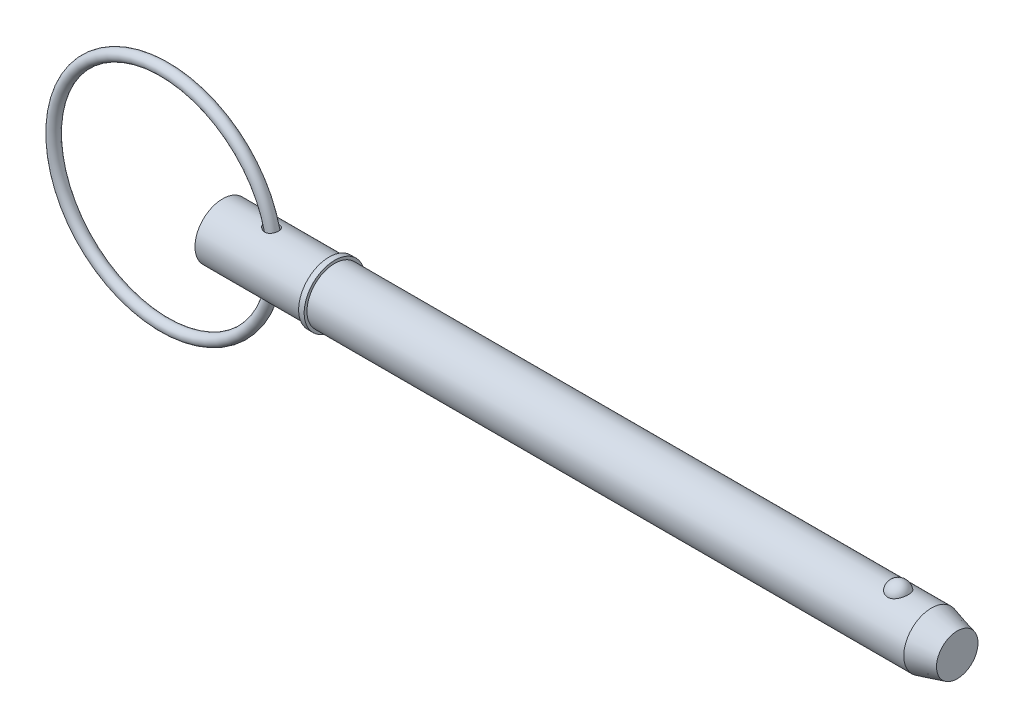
ISO-10303-21;
HEADER;
FILE_DESCRIPTION(('STEP AP214'),'2;1');
FILE_NAME('part.step','',(''),(''),'','','');
FILE_SCHEMA(('AUTOMOTIVE_DESIGN { 1 0 10303 214 1 1 1 1 }'));
ENDSEC;
DATA;
#1=APPLICATION_CONTEXT('core data for automotive mechanical design processes');
#2=APPLICATION_PROTOCOL_DEFINITION('international standard','automotive_design',2000,#1);
#3=PRODUCT_CONTEXT('',#1,'mechanical');
#4=PRODUCT('Part','Part','',(#3));
#5=PRODUCT_RELATED_PRODUCT_CATEGORY('part','',(#4));
#6=PRODUCT_DEFINITION_FORMATION('','',#4);
#7=PRODUCT_DEFINITION_CONTEXT('part definition',#1,'design');
#8=PRODUCT_DEFINITION('design','',#6,#7);
#9=PRODUCT_DEFINITION_SHAPE('','',#8);
#10=(LENGTH_UNIT() NAMED_UNIT(*) SI_UNIT(.MILLI.,.METRE.));
#11=(NAMED_UNIT(*) PLANE_ANGLE_UNIT() SI_UNIT($,.RADIAN.));
#12=(NAMED_UNIT(*) SI_UNIT($,.STERADIAN.) SOLID_ANGLE_UNIT());
#13=UNCERTAINTY_MEASURE_WITH_UNIT(LENGTH_MEASURE(1.E-05),#10,'distance_accuracy_value','');
#14=(GEOMETRIC_REPRESENTATION_CONTEXT(3) GLOBAL_UNCERTAINTY_ASSIGNED_CONTEXT((#13)) GLOBAL_UNIT_ASSIGNED_CONTEXT((#10,
#11,#12)) REPRESENTATION_CONTEXT('',''));
#15=CARTESIAN_POINT('',(0.,0.,0.));
#16=DIRECTION('',(0.,0.,1.));
#17=DIRECTION('',(1.,0.,0.));
#18=AXIS2_PLACEMENT_3D('',#15,#16,#17);
#19=CARTESIAN_POINT('',(-13.3798047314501,0.,0.));
#20=DIRECTION('',(0.,0.,1.));
#21=DIRECTION('',(1.,0.,0.));
#22=AXIS2_PLACEMENT_3D('',#19,#20,#21);
#23=TOROIDAL_SURFACE('',#22,25.4,1.27);
#24=CARTESIAN_POINT('',(13.2901952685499,0.,0.));
#25=VERTEX_POINT('',#24);
#26=VERTEX_LOOP('',#25);
#27=FACE_BOUND('',#26,.T.);
#28=ADVANCED_FACE('P0_F12',(#27),#23,.T.);
#29=CLOSED_SHELL('',(#28));
#30=MANIFOLD_SOLID_BREP('P0_B1',#29);
#31=CARTESIAN_POINT('',(0.,0.,0.));
#32=DIRECTION('',(1.,0.,0.));
#33=DIRECTION('',(0.,0.,-1.));
#34=AXIS2_PLACEMENT_3D('',#31,#32,#33);
#35=CYLINDRICAL_SURFACE('',#34,6.35);
#36=CARTESIAN_POINT('',(9.67500140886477,6.32698634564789,-0.540133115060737));
#37=CARTESIAN_POINT('',(9.70878953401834,6.3197498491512,-0.624879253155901));
#38=CARTESIAN_POINT('',(9.75028044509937,6.31105328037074,-0.706504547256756));
#39=CARTESIAN_POINT('',(9.84659255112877,6.29180070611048,-0.861319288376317));
#40=CARTESIAN_POINT('',(9.90144039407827,6.28124099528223,-0.934491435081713));
#41=CARTESIAN_POINT('',(10.021999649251,6.25949497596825,-1.0704877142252));
#42=CARTESIAN_POINT('',(10.0876589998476,6.2483118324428,-1.13335868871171));
#43=CARTESIAN_POINT('',(10.2280180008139,6.22641783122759,-1.24805262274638));
#44=CARTESIAN_POINT('',(10.3027159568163,6.21570688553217,-1.29987764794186));
#45=CARTESIAN_POINT('',(10.4650889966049,6.19509606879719,-1.39492899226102));
#46=CARTESIAN_POINT('',(10.5533142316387,6.1853135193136,-1.4372443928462));
#47=CARTESIAN_POINT('',(10.7357818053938,6.16871128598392,-1.50691441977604));
#48=CARTESIAN_POINT('',(10.8300253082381,6.16189217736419,-1.53426614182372));
#49=CARTESIAN_POINT('',(11.0227953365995,6.15211299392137,-1.57302798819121));
#50=CARTESIAN_POINT('',(11.1213511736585,6.14918579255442,-1.58430237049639));
#51=CARTESIAN_POINT('',(11.3189518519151,6.1478413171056,-1.58951619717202));
#52=CARTESIAN_POINT('',(11.417996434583,6.14942187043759,-1.58346399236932));
#53=CARTESIAN_POINT('',(11.6070859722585,6.15678569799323,-1.55457003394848));
#54=CARTESIAN_POINT('',(11.6973059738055,6.16229943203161,-1.53280404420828));
#55=CARTESIAN_POINT('',(11.8723373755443,6.17663058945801,-1.4739892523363));
#56=CARTESIAN_POINT('',(11.9571502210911,6.185447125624,-1.43694455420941));
#57=CARTESIAN_POINT('',(12.1146737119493,6.20482821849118,-1.35072170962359));
#58=CARTESIAN_POINT('',(12.1877743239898,6.21528554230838,-1.30222952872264));
#59=CARTESIAN_POINT('',(12.3246187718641,6.23705116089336,-1.19362916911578));
#60=CARTESIAN_POINT('',(12.3883628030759,6.24835943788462,-1.1335212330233));
#61=CARTESIAN_POINT('',(12.5046662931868,6.27053957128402,-1.00357204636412));
#62=CARTESIAN_POINT('',(12.5572571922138,6.28141258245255,-0.933759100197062));
#63=CARTESIAN_POINT('',(12.6502125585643,6.30157953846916,-0.786214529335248));
#64=CARTESIAN_POINT('',(12.6905764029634,6.31087340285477,-0.708482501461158));
#65=CARTESIAN_POINT('',(12.7585531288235,6.32699259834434,-0.546246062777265));
#66=CARTESIAN_POINT('',(12.7860022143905,6.33378599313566,-0.46166981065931));
#67=CARTESIAN_POINT('',(12.8267605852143,6.34401050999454,-0.288980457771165));
#68=CARTESIAN_POINT('',(12.8400695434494,6.34744155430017,-0.200867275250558));
#69=CARTESIAN_POINT('',(12.8522644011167,6.35058177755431,-0.023194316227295));
#70=CARTESIAN_POINT('',(12.8510870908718,6.35027464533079,0.0663700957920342));
#71=CARTESIAN_POINT('',(12.8341831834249,6.34593169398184,0.244024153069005));
#72=CARTESIAN_POINT('',(12.8184563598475,6.341895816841,0.332113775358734));
#73=CARTESIAN_POINT('',(12.7728208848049,6.33052992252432,0.504322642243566));
#74=CARTESIAN_POINT('',(12.7429114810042,6.32319973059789,0.58844167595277));
#75=CARTESIAN_POINT('',(12.6696162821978,6.30604116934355,0.750316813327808));
#76=CARTESIAN_POINT('',(12.6262302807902,6.29621276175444,0.828072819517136));
#77=CARTESIAN_POINT('',(12.5270856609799,6.27515240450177,0.974918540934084));
#78=CARTESIAN_POINT('',(12.4713403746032,6.26392197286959,1.04401746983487));
#79=CARTESIAN_POINT('',(12.3488662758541,6.24131002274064,1.1716478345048));
#80=CARTESIAN_POINT('',(12.2821384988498,6.22992851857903,1.23018026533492));
#81=CARTESIAN_POINT('',(12.1401870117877,6.20841765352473,1.33449214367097));
#82=CARTESIAN_POINT('',(12.0650507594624,6.19827734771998,1.38038832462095));
#83=CARTESIAN_POINT('',(11.9079044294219,6.18026478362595,1.45892404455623));
#84=CARTESIAN_POINT('',(11.8258951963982,6.17239224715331,1.49156520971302));
#85=CARTESIAN_POINT('',(11.6581736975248,6.15982613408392,1.54263810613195));
#86=CARTESIAN_POINT('',(11.572502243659,6.15510409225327,1.56119728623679));
#87=CARTESIAN_POINT('',(11.3991899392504,6.14916283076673,1.58443707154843));
#88=CARTESIAN_POINT('',(11.3115488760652,6.14794399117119,1.58911617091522));
#89=CARTESIAN_POINT('',(11.1345547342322,6.14904466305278,1.58485137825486));
#90=CARTESIAN_POINT('',(11.0452104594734,6.15144894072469,1.5755811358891));
#91=CARTESIAN_POINT('',(10.8691479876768,6.15957601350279,1.54349959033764));
#92=CARTESIAN_POINT('',(10.782430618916,6.16529984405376,1.52068406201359));
#93=CARTESIAN_POINT('',(10.6082848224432,6.17983892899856,1.4605156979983));
#94=CARTESIAN_POINT('',(10.5211557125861,6.1888262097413,1.42233764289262));
#95=CARTESIAN_POINT('',(10.3542377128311,6.20874782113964,1.33268652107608));
#96=CARTESIAN_POINT('',(10.2744521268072,6.21968302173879,1.28120750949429));
#97=CARTESIAN_POINT('',(10.120854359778,6.24282707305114,1.16334748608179));
#98=CARTESIAN_POINT('',(10.0474902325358,6.25507146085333,1.09638652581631));
#99=CARTESIAN_POINT('',(9.9136869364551,6.27890019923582,0.950453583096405));
#100=CARTESIAN_POINT('',(9.85324511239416,6.29048468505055,0.871484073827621));
#101=CARTESIAN_POINT('',(9.75037543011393,6.31102161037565,0.707140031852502));
#102=CARTESIAN_POINT('',(9.70726585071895,6.32006820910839,0.622206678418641));
#103=CARTESIAN_POINT('',(9.63775895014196,6.33497125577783,0.445490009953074));
#104=CARTESIAN_POINT('',(9.61134627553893,6.34083063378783,0.35371307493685));
#105=CARTESIAN_POINT('',(9.57891955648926,6.34807071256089,0.177220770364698));
#106=CARTESIAN_POINT('',(9.57093524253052,6.3498832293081,0.0928817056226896));
#107=CARTESIAN_POINT('',(9.56994851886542,6.35010532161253,-0.0758268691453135));
#108=CARTESIAN_POINT('',(9.57692695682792,6.34851924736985,-0.160196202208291));
#109=CARTESIAN_POINT('',(9.59985709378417,6.34339435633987,-0.294043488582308));
#110=CARTESIAN_POINT('',(9.61128951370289,6.34084912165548,-0.344385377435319));
#111=CARTESIAN_POINT('',(9.63933183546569,6.33468615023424,-0.443526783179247));
#112=CARTESIAN_POINT('',(9.65594100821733,6.33106856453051,-0.492326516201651));
#113=CARTESIAN_POINT('',(9.67500140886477,6.32698634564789,-0.540133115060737));
#114=B_SPLINE_CURVE_WITH_KNOTS('',3,(#36,#37,#38,#39,#40,#41,#42,#43,#44,#45,#46,#47,#48,#49,
#50,#51,#52,#53,#54,#55,#56,#57,#58,#59,#60,#61,#62,#63,#64,#65,#66,#67,#68,#69,#70,#71,#72,#73,
#74,#75,#76,#77,#78,#79,#80,#81,#82,#83,#84,#85,#86,#87,#88,#89,#90,#91,#92,#93,#94,#95,#96,#97,
#98,#99,#100,#101,#102,#103,#104,#105,#106,#107,#108,#109,#110,#111,#112,#113),.UNSPECIFIED.,
.T.,.F.,(4,2,2,2,2,2,2,2,2,2,2,2,2,2,2,2,2,2,2,2,2,2,2,2,2,2,2,2,2,2,2,2,2,2,2,2,2,2,4),(0.,
0.274348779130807,0.549249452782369,0.822863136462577,1.09642560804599,1.39007706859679,
1.68378550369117,1.97995934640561,2.27599046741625,2.55347281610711,2.83088067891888,
3.09465189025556,3.35841759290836,3.62142956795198,3.88445494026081,4.1507318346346,
4.4170148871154,4.68446025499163,4.95190978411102,5.21937350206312,5.48684131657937,
5.75402200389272,6.02117751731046,6.28577524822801,6.55034050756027,6.81248178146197,
7.0746514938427,7.34305086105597,7.61153399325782,7.89692981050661,8.18245340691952,
8.48120635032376,8.77989784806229,9.06530254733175,9.35044442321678,9.60331609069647,
9.85586427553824,10.010650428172,10.1654147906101),.UNSPECIFIED.);
#115=CARTESIAN_POINT('',(9.67500140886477,6.32698634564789,-0.540133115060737));
#116=VERTEX_POINT('',#115);
#117=EDGE_CURVE('P1_E42',#116,#116,#114,.T.);
#118=ORIENTED_EDGE('',*,*,#117,.T.);
#119=EDGE_LOOP('',(#118));
#120=FACE_BOUND('',#119,.T.);
#121=CARTESIAN_POINT('',(0.,0.,0.));
#122=DIRECTION('',(1.,0.,0.));
#123=DIRECTION('',(0.,0.,-1.));
#124=AXIS2_PLACEMENT_3D('',#121,#122,#123);
#125=CIRCLE('',#124,6.35);
#126=CARTESIAN_POINT('',(0.,0.,-6.35));
#127=VERTEX_POINT('',#126);
#128=EDGE_CURVE('P1_E9',#127,#127,#125,.T.);
#129=ORIENTED_EDGE('',*,*,#128,.T.);
#130=EDGE_LOOP('',(#129));
#131=FACE_BOUND('',#130,.T.);
#132=CARTESIAN_POINT('',(24.43,0.,0.));
#133=DIRECTION('',(1.,0.,0.));
#134=DIRECTION('',(0.,0.,-1.));
#135=AXIS2_PLACEMENT_3D('',#132,#133,#134);
#136=CIRCLE('',#135,6.35);
#137=CARTESIAN_POINT('',(24.43,0.,-6.35));
#138=VERTEX_POINT('',#137);
#139=EDGE_CURVE('P1_E25',#138,#138,#136,.T.);
#140=ORIENTED_EDGE('',*,*,#139,.F.);
#141=EDGE_LOOP('',(#140));
#142=FACE_BOUND('',#141,.T.);
#143=CARTESIAN_POINT('',(9.67500140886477,-6.32698634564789,-0.540133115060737));
#144=CARTESIAN_POINT('',(9.64544894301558,-6.33331515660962,-0.466002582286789));
#145=CARTESIAN_POINT('',(9.62177180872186,-6.33852974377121,-0.389437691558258));
#146=CARTESIAN_POINT('',(9.58727043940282,-6.34619174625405,-0.233330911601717));
#147=CARTESIAN_POINT('',(9.57644043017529,-6.34864040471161,-0.153790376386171));
#148=CARTESIAN_POINT('',(9.56819517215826,-6.3505010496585,0.00612071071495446));
#149=CARTESIAN_POINT('',(9.57079639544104,-6.34990930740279,0.0864921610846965));
#150=CARTESIAN_POINT('',(9.58930797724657,-6.3457478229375,0.245607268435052));
#151=CARTESIAN_POINT('',(9.60522046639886,-6.34217760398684,0.324350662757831));
#152=CARTESIAN_POINT('',(9.64931570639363,-6.3324977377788,0.47727605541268));
#153=CARTESIAN_POINT('',(9.67737525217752,-6.32641361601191,0.551495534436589));
#154=CARTESIAN_POINT('',(9.74451510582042,-6.31231128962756,0.694551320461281));
#155=CARTESIAN_POINT('',(9.78359827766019,-6.30429258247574,0.763386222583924));
#156=CARTESIAN_POINT('',(9.87474700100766,-6.28638332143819,0.899414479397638));
#157=CARTESIAN_POINT('',(9.92757481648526,-6.27639669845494,0.966083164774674));
#158=CARTESIAN_POINT('',(10.042675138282,-6.25596164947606,1.09061181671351));
#159=CARTESIAN_POINT('',(10.1049521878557,-6.24551300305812,1.14846751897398));
#160=CARTESIAN_POINT('',(10.2445505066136,-6.22397505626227,1.26024641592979));
#161=CARTESIAN_POINT('',(10.3227711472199,-6.2129394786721,1.31305951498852));
#162=CARTESIAN_POINT('',(10.4867924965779,-6.19263757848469,1.40570084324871));
#163=CARTESIAN_POINT('',(10.5725962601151,-6.18337197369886,1.44552380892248));
#164=CARTESIAN_POINT('',(10.7543302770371,-6.16725983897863,1.51283687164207));
#165=CARTESIAN_POINT('',(10.8505554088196,-6.16056505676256,1.53957358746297));
#166=CARTESIAN_POINT('',(11.0463546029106,-6.15127671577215,1.57628137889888));
#167=CARTESIAN_POINT('',(11.1459276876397,-6.14868197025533,1.58625730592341));
#168=CARTESIAN_POINT('',(11.3414257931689,-6.14810798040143,1.58848000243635));
#169=CARTESIAN_POINT('',(11.4373417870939,-6.14995283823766,1.58140242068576));
#170=CARTESIAN_POINT('',(11.6262783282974,-6.1577972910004,1.55057566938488));
#171=CARTESIAN_POINT('',(11.719300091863,-6.16379511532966,1.52683360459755));
#172=CARTESIAN_POINT('',(11.8934223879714,-6.17873566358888,1.46514575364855));
#173=CARTESIAN_POINT('',(11.9749048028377,-6.18746207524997,1.42822144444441));
#174=CARTESIAN_POINT('',(12.1301362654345,-6.20693584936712,1.3410564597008));
#175=CARTESIAN_POINT('',(12.2038861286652,-6.21768299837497,1.29081719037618));
#176=CARTESIAN_POINT('',(12.3399792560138,-6.23970077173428,1.17972764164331));
#177=CARTESIAN_POINT('',(12.4025430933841,-6.25095401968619,1.11914355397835));
#178=CARTESIAN_POINT('',(12.5166805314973,-6.27296916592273,0.988307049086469));
#179=CARTESIAN_POINT('',(12.568253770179,-6.28373104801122,0.918054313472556));
#180=CARTESIAN_POINT('',(12.6596230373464,-6.3037060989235,0.769081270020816));
#181=CARTESIAN_POINT('',(12.6992956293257,-6.31290263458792,0.690283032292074));
#182=CARTESIAN_POINT('',(12.7652258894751,-6.32862394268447,0.527011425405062));
#183=CARTESIAN_POINT('',(12.7914829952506,-6.33514860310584,0.442537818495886));
#184=CARTESIAN_POINT('',(12.8301436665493,-6.34487485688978,0.269505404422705));
#185=CARTESIAN_POINT('',(12.8424230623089,-6.34804664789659,0.180917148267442));
#186=CARTESIAN_POINT('',(12.8524214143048,-6.35062347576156,0.00286829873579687));
#187=CARTESIAN_POINT('',(12.8501402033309,-6.35002846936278,-0.0865923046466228));
#188=CARTESIAN_POINT('',(12.8310619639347,-6.34513332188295,-0.263931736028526));
#189=CARTESIAN_POINT('',(12.8142517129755,-6.34082980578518,-0.35180904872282));
#190=CARTESIAN_POINT('',(12.7664911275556,-6.32897674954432,-0.523406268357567));
#191=CARTESIAN_POINT('',(12.7355404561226,-6.3214271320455,-0.607126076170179));
#192=CARTESIAN_POINT('',(12.6602298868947,-6.30390232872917,-0.768030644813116));
#193=CARTESIAN_POINT('',(12.6158695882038,-6.29392707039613,-0.84521521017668));
#194=CARTESIAN_POINT('',(12.5148171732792,-6.2726521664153,-0.990836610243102));
#195=CARTESIAN_POINT('',(12.4581254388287,-6.26135256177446,-1.05927371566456));
#196=CARTESIAN_POINT('',(12.33416419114,-6.2387572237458,-1.18510935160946));
#197=CARTESIAN_POINT('',(12.2669484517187,-6.22746174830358,-1.24256086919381));
#198=CARTESIAN_POINT('',(12.1235592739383,-6.20610255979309,-1.34519464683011));
#199=CARTESIAN_POINT('',(12.0473871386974,-6.19603866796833,-1.39037868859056));
#200=CARTESIAN_POINT('',(11.8892714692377,-6.17839642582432,-1.46678006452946));
#201=CARTESIAN_POINT('',(11.8074126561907,-6.17078838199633,-1.49816605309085));
#202=CARTESIAN_POINT('',(11.6394563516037,-6.15869606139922,-1.54712759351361));
#203=CARTESIAN_POINT('',(11.5533589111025,-6.15421174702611,-1.56470331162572));
#204=CARTESIAN_POINT('',(11.3789660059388,-6.14876652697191,-1.58596734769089));
#205=CARTESIAN_POINT('',(11.2906621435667,-6.1478222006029,-1.58959032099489));
#206=CARTESIAN_POINT('',(11.1146029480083,-6.149490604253,-1.58312110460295));
#207=CARTESIAN_POINT('',(11.0268477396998,-6.1521041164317,-1.57302589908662));
#208=CARTESIAN_POINT('',(10.8498668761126,-6.16071031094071,-1.53898332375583));
#209=CARTESIAN_POINT('',(10.7607726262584,-6.16685908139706,-1.51439468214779));
#210=CARTESIAN_POINT('',(10.5876521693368,-6.18189031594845,-1.45181305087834));
#211=CARTESIAN_POINT('',(10.5036282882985,-6.19077402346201,-1.41381396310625));
#212=CARTESIAN_POINT('',(10.3374228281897,-6.2109378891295,-1.32252480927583));
#213=CARTESIAN_POINT('',(10.255708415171,-6.2223355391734,-1.26840756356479));
#214=CARTESIAN_POINT('',(10.1025645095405,-6.24580740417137,-1.14725208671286));
#215=CARTESIAN_POINT('',(10.0311354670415,-6.25788164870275,-1.08021329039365));
#216=CARTESIAN_POINT('',(9.90472699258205,-6.2806176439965,-0.938710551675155));
#217=CARTESIAN_POINT('',(9.84904456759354,-6.29132066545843,-0.864883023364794));
#218=CARTESIAN_POINT('',(9.75129345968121,-6.31084098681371,-0.708496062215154));
#219=CARTESIAN_POINT('',(9.70921094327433,-6.31966019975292,-0.625945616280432));
#220=CARTESIAN_POINT('',(9.67500140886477,-6.32698634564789,-0.540133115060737));
#221=B_SPLINE_CURVE_WITH_KNOTS('',3,(#143,#144,#145,#146,#147,#148,#149,#150,#151,#152,#153,
#154,#155,#156,#157,#158,#159,#160,#161,#162,#163,#164,#165,#166,#167,#168,#169,#170,#171,#172,
#173,#174,#175,#176,#177,#178,#179,#180,#181,#182,#183,#184,#185,#186,#187,#188,#189,#190,#191,
#192,#193,#194,#195,#196,#197,#198,#199,#200,#201,#202,#203,#204,#205,#206,#207,#208,#209,#210,
#211,#212,#213,#214,#215,#216,#217,#218,#219,#220),.UNSPECIFIED.,.T.,.F.,(4,2,2,2,2,2,2,2,2,2,2,
2,2,2,2,2,2,2,2,2,2,2,2,2,2,2,2,2,2,2,2,2,2,2,2,2,2,2,4),(0.,0.239871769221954,
0.479635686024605,0.719693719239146,0.959790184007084,1.19750645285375,1.43528453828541,
1.69117930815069,1.94719750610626,2.23102979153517,2.51497694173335,2.81376497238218,
3.11246650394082,3.39952951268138,3.68647020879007,3.95479420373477,4.22308987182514,
4.48530700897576,4.74753278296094,5.01239119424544,5.27726070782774,5.54446524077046,
5.81167284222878,6.07912387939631,6.34658129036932,6.61404669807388,6.88150382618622,
7.14763644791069,7.41373039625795,7.67647472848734,7.93921589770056,8.20318607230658,
8.46721428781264,8.74390821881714,9.02072813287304,9.31537622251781,9.61003720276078,
9.88799314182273,10.1656654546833),.UNSPECIFIED.);
#222=CARTESIAN_POINT('',(9.67500140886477,-6.32698634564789,-0.540133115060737));
#223=VERTEX_POINT('',#222);
#224=EDGE_CURVE('P1_E17',#223,#223,#221,.T.);
#225=ORIENTED_EDGE('',*,*,#224,.T.);
#226=EDGE_LOOP('',(#225));
#227=FACE_BOUND('',#226,.T.);
#228=ADVANCED_FACE('P1_F13',(#120,#131,#142,#227),#35,.T.);
#229=CARTESIAN_POINT('',(0.,0.,0.));
#230=DIRECTION('',(1.,0.,0.));
#231=DIRECTION('',(0.,0.,-1.));
#232=AXIS2_PLACEMENT_3D('',#229,#230,#231);
#233=CYLINDRICAL_SURFACE('',#232,6.35);
#234=CARTESIAN_POINT('',(162.655369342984,0.,0.));
#235=DIRECTION('',(1.,0.,0.));
#236=DIRECTION('',(0.,0.,-1.));
#237=AXIS2_PLACEMENT_3D('',#234,#235,#236);
#238=CIRCLE('',#237,6.35);
#239=CARTESIAN_POINT('',(162.655369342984,0.,-6.35));
#240=VERTEX_POINT('',#239);
#241=EDGE_CURVE('P1_E99',#240,#240,#238,.T.);
#242=ORIENTED_EDGE('',*,*,#241,.F.);
#243=EDGE_LOOP('',(#242));
#244=FACE_BOUND('',#243,.T.);
#245=CARTESIAN_POINT('',(25.7,0.,0.));
#246=DIRECTION('',(1.,0.,0.));
#247=DIRECTION('',(0.,0.,-1.));
#248=AXIS2_PLACEMENT_3D('',#245,#246,#247);
#249=CIRCLE('',#248,6.35);
#250=CARTESIAN_POINT('',(25.7,0.,-6.35));
#251=VERTEX_POINT('',#250);
#252=EDGE_CURVE('P1_E96',#251,#251,#249,.T.);
#253=ORIENTED_EDGE('',*,*,#252,.T.);
#254=EDGE_LOOP('',(#253));
#255=FACE_BOUND('',#254,.T.);
#256=CARTESIAN_POINT('',(155.030021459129,5.87502187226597,2.40969251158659));
#257=CARTESIAN_POINT('',(154.905030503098,5.87501645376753,2.40969773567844));
#258=CARTESIAN_POINT('',(154.780080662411,5.87916061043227,2.39967292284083));
#259=CARTESIAN_POINT('',(154.533909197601,5.8952311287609,2.35991730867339));
#260=CARTESIAN_POINT('',(154.412686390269,5.90715499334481,2.33019283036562));
#261=CARTESIAN_POINT('',(154.177517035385,5.93739567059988,2.25201402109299));
#262=CARTESIAN_POINT('',(154.063560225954,5.95570321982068,2.20358681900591));
#263=CARTESIAN_POINT('',(153.84557352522,5.99672067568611,2.08937987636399));
#264=CARTESIAN_POINT('',(153.741545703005,6.01943149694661,2.02359652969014));
#265=CARTESIAN_POINT('',(153.542943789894,6.06760647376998,1.87428969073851));
#266=CARTESIAN_POINT('',(153.448726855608,6.09313095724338,1.79031110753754));
#267=CARTESIAN_POINT('',(153.275255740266,6.14375873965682,1.60800178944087));
#268=CARTESIAN_POINT('',(153.196004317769,6.16886196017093,1.50966841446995));
#269=CARTESIAN_POINT('',(153.050845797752,6.21724600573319,1.29645884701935));
#270=CARTESIAN_POINT('',(152.985688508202,6.24039621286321,1.1810415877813));
#271=CARTESIAN_POINT('',(152.874703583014,6.28117277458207,0.940351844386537));
#272=CARTESIAN_POINT('',(152.828877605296,6.29879865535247,0.815078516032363));
#273=CARTESIAN_POINT('',(152.757023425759,6.32692073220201,0.556494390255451));
#274=CARTESIAN_POINT('',(152.731249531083,6.33732517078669,0.423102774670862));
#275=CARTESIAN_POINT('',(152.700988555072,6.34957673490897,0.15354272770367));
#276=CARTESIAN_POINT('',(152.696500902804,6.35142408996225,0.0173743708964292));
#277=CARTESIAN_POINT('',(152.708865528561,6.34638925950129,-0.253036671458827));
#278=CARTESIAN_POINT('',(152.725594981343,6.33955731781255,-0.387285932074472));
#279=CARTESIAN_POINT('',(152.779843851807,6.31794129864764,-0.650851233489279));
#280=CARTESIAN_POINT('',(152.817363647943,6.30315707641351,-0.780167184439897));
#281=CARTESIAN_POINT('',(152.912500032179,6.26711642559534,-1.03041949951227));
#282=CARTESIAN_POINT('',(152.970143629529,6.24585130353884,-1.1513443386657));
#283=CARTESIAN_POINT('',(153.104352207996,6.19905619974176,-1.38129800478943));
#284=CARTESIAN_POINT('',(153.180918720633,6.17352587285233,-1.49032586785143));
#285=CARTESIAN_POINT('',(153.351753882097,6.12080227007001,-1.69393164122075));
#286=CARTESIAN_POINT('',(153.446100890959,6.09360200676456,-1.78844209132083));
#287=CARTESIAN_POINT('',(153.650119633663,6.04070434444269,-1.95970536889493));
#288=CARTESIAN_POINT('',(153.759790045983,6.01500681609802,-2.03645972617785));
#289=CARTESIAN_POINT('',(153.989187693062,5.96867714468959,-2.16845644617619));
#290=CARTESIAN_POINT('',(154.108652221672,5.94794910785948,-2.22412062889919));
#291=CARTESIAN_POINT('',(154.356218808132,5.91340580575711,-2.31440992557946));
#292=CARTESIAN_POINT('',(154.484317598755,5.8995879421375,-2.3490429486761));
#293=CARTESIAN_POINT('',(154.738582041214,5.88111049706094,-2.39491590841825));
#294=CARTESIAN_POINT('',(154.864520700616,5.876025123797,-2.40724512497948));
#295=CARTESIAN_POINT('',(155.116786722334,5.87428980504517,-2.41147867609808));
#296=CARTESIAN_POINT('',(155.243114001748,5.87763817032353,-2.40338710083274));
#297=CARTESIAN_POINT('',(155.488417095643,5.89212921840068,-2.36762715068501));
#298=CARTESIAN_POINT('',(155.607499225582,5.90302431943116,-2.34058030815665));
#299=CARTESIAN_POINT('',(155.83924472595,5.93113752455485,-2.26839066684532));
#300=CARTESIAN_POINT('',(155.951907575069,5.94835614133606,-2.22324640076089));
#301=CARTESIAN_POINT('',(156.170400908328,5.98773016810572,-2.11493806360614));
#302=CARTESIAN_POINT('',(156.276028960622,6.00998499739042,-2.05140269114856));
#303=CARTESIAN_POINT('',(156.475300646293,6.05690144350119,-1.90842705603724));
#304=CARTESIAN_POINT('',(156.568941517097,6.08156361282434,-1.82898313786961));
#305=CARTESIAN_POINT('',(156.746675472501,6.13211715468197,-1.65182429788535));
#306=CARTESIAN_POINT('',(156.830055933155,6.15800825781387,-1.55339381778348));
#307=CARTESIAN_POINT('',(156.979790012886,6.20712834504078,-1.34374214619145));
#308=CARTESIAN_POINT('',(157.046140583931,6.23035685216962,-1.23251867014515));
#309=CARTESIAN_POINT('',(157.162345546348,6.27251177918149,-0.996447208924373));
#310=CARTESIAN_POINT('',(157.211607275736,6.29127762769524,-0.871278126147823));
#311=CARTESIAN_POINT('',(157.289614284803,6.3215862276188,-0.613870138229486));
#312=CARTESIAN_POINT('',(157.318359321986,6.33312889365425,-0.481631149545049));
#313=CARTESIAN_POINT('',(157.35477058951,6.34782349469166,-0.213672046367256));
#314=CARTESIAN_POINT('',(157.362413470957,6.35096613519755,-0.0779482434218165));
#315=CARTESIAN_POINT('',(157.356395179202,6.34851322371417,0.192943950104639));
#316=CARTESIAN_POINT('',(157.342734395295,6.3429178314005,0.328112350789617));
#317=CARTESIAN_POINT('',(157.29450361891,6.32360512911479,0.593406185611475));
#318=CARTESIAN_POINT('',(157.260031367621,6.30992579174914,0.7235521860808));
#319=CARTESIAN_POINT('',(157.170953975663,6.27586325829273,0.975834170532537));
#320=CARTESIAN_POINT('',(157.11634761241,6.25547965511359,1.09796966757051));
#321=CARTESIAN_POINT('',(156.98775879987,6.20998183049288,1.33148921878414));
#322=CARTESIAN_POINT('',(156.913674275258,6.18484288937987,1.44281227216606));
#323=CARTESIAN_POINT('',(156.747820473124,6.13258735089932,1.65087683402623));
#324=CARTESIAN_POINT('',(156.656051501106,6.10547078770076,1.74761859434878));
#325=CARTESIAN_POINT('',(156.457183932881,6.05235879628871,1.92350926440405));
#326=CARTESIAN_POINT('',(156.350133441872,6.0263601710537,2.00271146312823));
#327=CARTESIAN_POINT('',(156.123138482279,5.97843747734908,2.1415415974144));
#328=CARTESIAN_POINT('',(156.003191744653,5.95651412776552,2.20116608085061));
#329=CARTESIAN_POINT('',(155.744523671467,5.91812106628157,2.30250570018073));
#330=CARTESIAN_POINT('',(155.60506980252,5.90217533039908,2.34256795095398));
#331=CARTESIAN_POINT('',(155.320397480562,5.88063128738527,2.39615214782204));
#332=CARTESIAN_POINT('',(155.17518174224,5.8750281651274,2.40968644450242));
#333=CARTESIAN_POINT('',(155.030021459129,5.87502187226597,2.40969251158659));
#334=B_SPLINE_CURVE_WITH_KNOTS('',3,(#256,#257,#258,#259,#260,#261,#262,#263,#264,#265,#266,
#267,#268,#269,#270,#271,#272,#273,#274,#275,#276,#277,#278,#279,#280,#281,#282,#283,#284,#285,
#286,#287,#288,#289,#290,#291,#292,#293,#294,#295,#296,#297,#298,#299,#300,#301,#302,#303,#304,
#305,#306,#307,#308,#309,#310,#311,#312,#313,#314,#315,#316,#317,#318,#319,#320,#321,#322,#323,
#324,#325,#326,#327,#328,#329,#330,#331,#332,#333),.UNSPECIFIED.,.T.,.F.,(4,2,2,2,2,2,2,2,2,2,2,
2,2,2,2,2,2,2,2,2,2,2,2,2,2,2,2,2,2,2,2,2,2,2,2,2,2,2,4),(0.,0.374440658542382,
0.748761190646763,1.12254078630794,1.49639810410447,1.88098871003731,2.2656501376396,
2.66741104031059,3.06920639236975,3.47601794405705,3.88281858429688,4.28727498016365,
4.69173873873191,5.09674745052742,5.50178895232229,5.90865911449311,6.31549420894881,
6.71369855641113,7.11175305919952,7.48978077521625,7.86773278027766,8.23383886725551,
8.59997464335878,8.97409044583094,9.34829231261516,9.74122667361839,10.1342313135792,
10.5397522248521,10.9452779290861,11.3512521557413,11.7572189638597,12.1612938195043,
12.5653932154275,12.9716540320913,13.3779078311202,13.7829098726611,14.1879832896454,
14.6230486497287,15.0579114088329),.UNSPECIFIED.);
#335=CARTESIAN_POINT('',(155.030021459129,5.87502187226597,2.40969251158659));
#336=VERTEX_POINT('',#335);
#337=EDGE_CURVE('P1_E34',#336,#336,#334,.T.);
#338=ORIENTED_EDGE('',*,*,#337,.T.);
#339=EDGE_LOOP('',(#338));
#340=FACE_BOUND('',#339,.T.);
#341=ADVANCED_FACE('P1_F46',(#244,#255,#340),#233,.T.);
#342=CARTESIAN_POINT('',(0.,0.,0.));
#343=DIRECTION('',(-1.,0.,0.));
#344=DIRECTION('',(0.,0.,1.));
#345=AXIS2_PLACEMENT_3D('',#342,#343,#344);
#346=PLANE('',#345);
#347=ORIENTED_EDGE('',*,*,#128,.F.);
#348=EDGE_LOOP('',(#347));
#349=FACE_BOUND('',#348,.T.);
#350=ADVANCED_FACE('P1_F15',(#349),#346,.T.);
#351=CARTESIAN_POINT('',(24.43,6.35,0.));
#352=DIRECTION('',(-1.,0.,0.));
#353=DIRECTION('',(0.,0.,1.));
#354=AXIS2_PLACEMENT_3D('',#351,#352,#353);
#355=PLANE('',#354);
#356=ORIENTED_EDGE('',*,*,#139,.T.);
#357=EDGE_LOOP('',(#356));
#358=FACE_BOUND('',#357,.T.);
#359=CARTESIAN_POINT('',(24.43,0.,0.));
#360=DIRECTION('',(1.,0.,0.));
#361=DIRECTION('',(0.,0.,-1.));
#362=AXIS2_PLACEMENT_3D('',#359,#360,#361);
#363=CIRCLE('',#362,6.985);
#364=CARTESIAN_POINT('',(24.43,0.,-6.985));
#365=VERTEX_POINT('',#364);
#366=EDGE_CURVE('P1_E30',#365,#365,#363,.T.);
#367=ORIENTED_EDGE('',*,*,#366,.F.);
#368=EDGE_LOOP('',(#367));
#369=FACE_BOUND('',#368,.T.);
#370=ADVANCED_FACE('P1_F81',(#358,#369),#355,.T.);
#371=CARTESIAN_POINT('',(0.,0.,0.));
#372=DIRECTION('',(1.,0.,0.));
#373=DIRECTION('',(0.,0.,-1.));
#374=AXIS2_PLACEMENT_3D('',#371,#372,#373);
#375=CYLINDRICAL_SURFACE('',#374,6.985);
#376=ORIENTED_EDGE('',*,*,#366,.T.);
#377=EDGE_LOOP('',(#376));
#378=FACE_BOUND('',#377,.T.);
#379=CARTESIAN_POINT('',(25.7,0.,0.));
#380=DIRECTION('',(1.,0.,0.));
#381=DIRECTION('',(0.,0.,-1.));
#382=AXIS2_PLACEMENT_3D('',#379,#380,#381);
#383=CIRCLE('',#382,6.985);
#384=CARTESIAN_POINT('',(25.7,0.,-6.985));
#385=VERTEX_POINT('',#384);
#386=EDGE_CURVE('P1_E95',#385,#385,#383,.T.);
#387=ORIENTED_EDGE('',*,*,#386,.F.);
#388=EDGE_LOOP('',(#387));
#389=FACE_BOUND('',#388,.T.);
#390=ADVANCED_FACE('P1_F68',(#378,#389),#375,.T.);
#391=CARTESIAN_POINT('',(25.7,6.985,0.));
#392=DIRECTION('',(1.,0.,0.));
#393=DIRECTION('',(0.,0.,-1.));
#394=AXIS2_PLACEMENT_3D('',#391,#392,#393);
#395=PLANE('',#394);
#396=ORIENTED_EDGE('',*,*,#386,.T.);
#397=EDGE_LOOP('',(#396));
#398=FACE_BOUND('',#397,.T.);
#399=ORIENTED_EDGE('',*,*,#252,.F.);
#400=EDGE_LOOP('',(#399));
#401=FACE_BOUND('',#400,.T.);
#402=ADVANCED_FACE('P1_F62',(#398,#401),#395,.T.);
#403=CARTESIAN_POINT('',(168.58,0.,0.));
#404=DIRECTION('',(-1.,0.,0.));
#405=DIRECTION('',(0.,0.,1.));
#406=AXIS2_PLACEMENT_3D('',#403,#404,#405);
#407=CONICAL_SURFACE('',#406,4.76250000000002,0.26179938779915);
#408=ORIENTED_EDGE('',*,*,#241,.T.);
#409=EDGE_LOOP('',(#408));
#410=FACE_BOUND('',#409,.T.);
#411=CARTESIAN_POINT('',(168.58,0.,0.));
#412=DIRECTION('',(1.,0.,0.));
#413=DIRECTION('',(0.,0.,-1.));
#414=AXIS2_PLACEMENT_3D('',#411,#412,#413);
#415=CIRCLE('',#414,4.76250000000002);
#416=CARTESIAN_POINT('',(168.58,0.,-4.76250000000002));
#417=VERTEX_POINT('',#416);
#418=EDGE_CURVE('P1_E41',#417,#417,#415,.T.);
#419=ORIENTED_EDGE('',*,*,#418,.F.);
#420=EDGE_LOOP('',(#419));
#421=FACE_BOUND('',#420,.T.);
#422=ADVANCED_FACE('P1_F59',(#410,#421),#407,.T.);
#423=CARTESIAN_POINT('',(168.58,4.76250000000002,0.));
#424=DIRECTION('',(1.,0.,0.));
#425=DIRECTION('',(0.,0.,-1.));
#426=AXIS2_PLACEMENT_3D('',#423,#424,#425);
#427=PLANE('',#426);
#428=ORIENTED_EDGE('',*,*,#418,.T.);
#429=EDGE_LOOP('',(#428));
#430=FACE_BOUND('',#429,.T.);
#431=ADVANCED_FACE('P1_F55',(#430),#427,.T.);
#432=CARTESIAN_POINT('',(155.030021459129,5.715,0.));
#433=DIRECTION('',(-1.,0.,0.));
#434=DIRECTION('',(0.,1.,0.));
#435=AXIS2_PLACEMENT_3D('',#432,#433,#434);
#436=SPHERICAL_SURFACE('',#435,2.415);
#437=ORIENTED_EDGE('',*,*,#337,.F.);
#438=EDGE_LOOP('',(#437));
#439=FACE_BOUND('',#438,.T.);
#440=ADVANCED_FACE('P1_F50',(#439),#436,.T.);
#441=CARTESIAN_POINT('',(-13.3798047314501,0.,0.));
#442=DIRECTION('',(0.,0.,1.));
#443=DIRECTION('',(1.,0.,0.));
#444=AXIS2_PLACEMENT_3D('',#441,#442,#443);
#445=TOROIDAL_SURFACE('',#444,25.4,1.5875);
#446=ORIENTED_EDGE('',*,*,#224,.F.);
#447=EDGE_LOOP('',(#446));
#448=FACE_BOUND('',#447,.T.);
#449=ORIENTED_EDGE('',*,*,#117,.F.);
#450=EDGE_LOOP('',(#449));
#451=FACE_BOUND('',#450,.T.);
#452=ADVANCED_FACE('P1_F54',(#448,#451),#445,.F.);
#453=CLOSED_SHELL('',(#228,#341,#350,#370,#390,#402,#422,#431,#440,#452));
#454=MANIFOLD_SOLID_BREP('P1_B1',#453);
#455=ADVANCED_BREP_SHAPE_REPRESENTATION('',(#18,#30,#454),#14);
#456=SHAPE_DEFINITION_REPRESENTATION(#9,#455);
ENDSEC;
END-ISO-10303-21;
